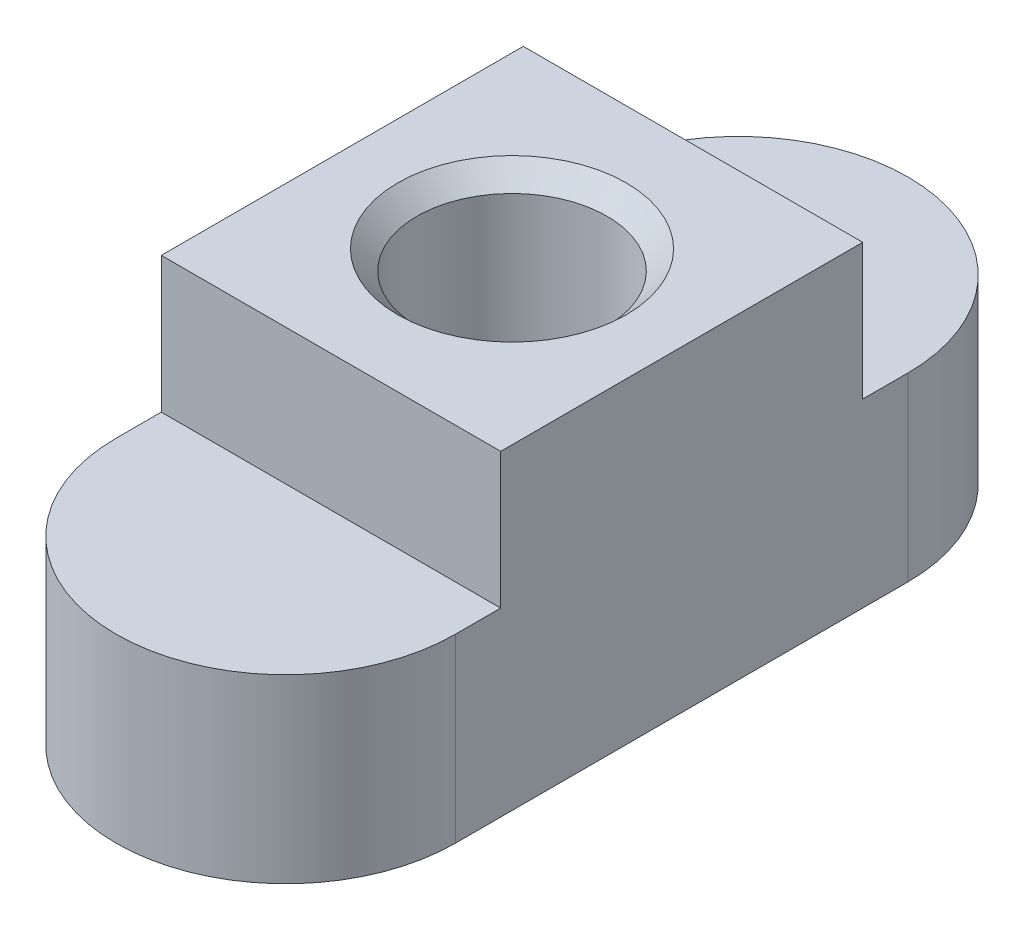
from build123d import *

# Parameters (mm, degrees)
AUFSATZ_LINEAR_AUSTRAGEN1_DEPTH = 4
SKIZZE2_W                       = 7.5
SKIZZE2_H                       = 8
AUFSATZ_LINEAR_AUSTRAGEN2_DEPTH = 3
M5_GEWINDEBOHRUNG1_D            = 4.2
M5_GEWINDEBOHRUNG1_CSINK_D      = 5.05
M5_GEWINDEBOHRUNG1_CSINK_ANGLE  = 90


with BuildPart() as part:
    # Skizze1 → Aufsatz-Linear austragen1 (new body)
    with BuildSketch(Plane(origin=(0, 0, 0), x_dir=(1, 0, 0), z_dir=(0, 1, 0))):
        with BuildLine():
            Line((-3.75, -5), (-3.75, 5))
            ThreePointArc((-3.75, 5), (0, 8.75), (3.75, 5))
            Line((3.75, 5), (3.75, -5))
            ThreePointArc((3.75, -5), (0, -8.75), (-3.75, -5))
        make_face()
    extrude(amount=AUFSATZ_LINEAR_AUSTRAGEN1_DEPTH)

    # Skizze2 → Aufsatz-Linear austragen2 (add)
    with BuildSketch(Plane(origin=(0, 4, 0), x_dir=(1, 0, 0), z_dir=(0, 1, 0))):
        Rectangle(SKIZZE2_W, SKIZZE2_H)
    extrude(amount=AUFSATZ_LINEAR_AUSTRAGEN2_DEPTH)

    # M5 Gewindebohrung1 (through all)
    with Locations(Plane(origin=(0, 7, 0), x_dir=(1, 0, 0), z_dir=(0, 1, 0))):
        with Locations((0, 0)):
            CounterSinkHole(M5_GEWINDEBOHRUNG1_D / 2, M5_GEWINDEBOHRUNG1_CSINK_D / 2, counter_sink_angle=M5_GEWINDEBOHRUNG1_CSINK_ANGLE)


solid = part.part
